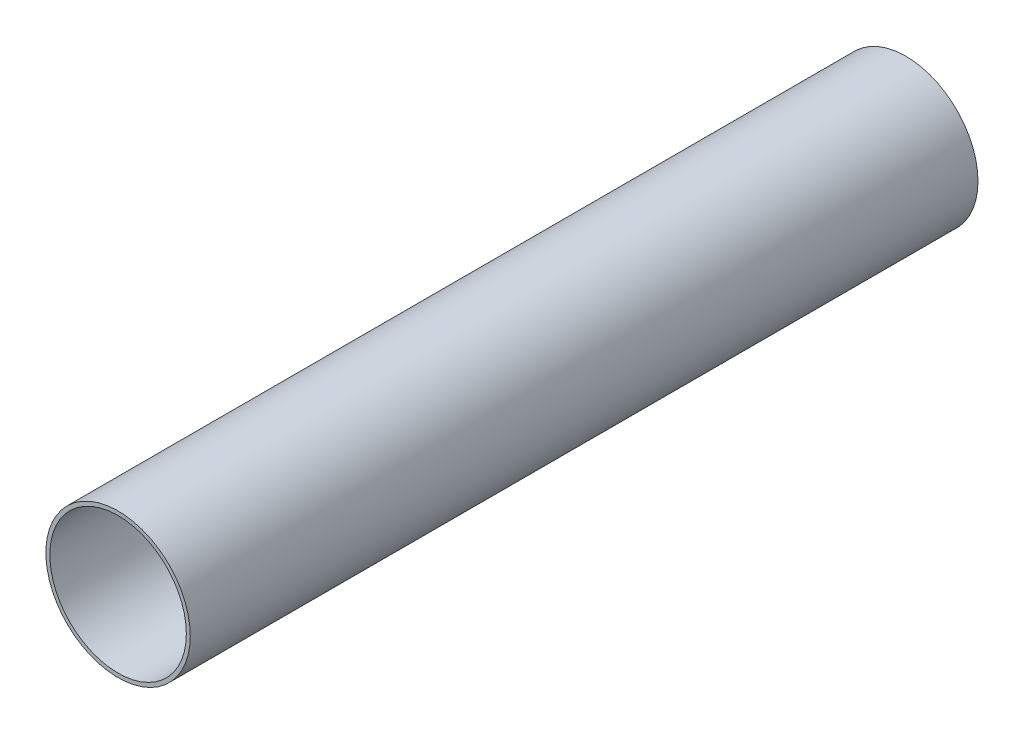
from build123d import *

# Parameters (mm, degrees)
ESQUISSE1_R          = 110
ESQUISSE1_R_2        = 104
BASE_EXTRUSION_DEPTH = 1200


with BuildPart() as part:
    # Esquisse1 → Base-Extrusion (new body)
    with BuildSketch(Plane.XY):
        Circle(ESQUISSE1_R)
        Circle(ESQUISSE1_R_2, mode=Mode.SUBTRACT)
    extrude(amount=BASE_EXTRUSION_DEPTH)


solid = part.part
